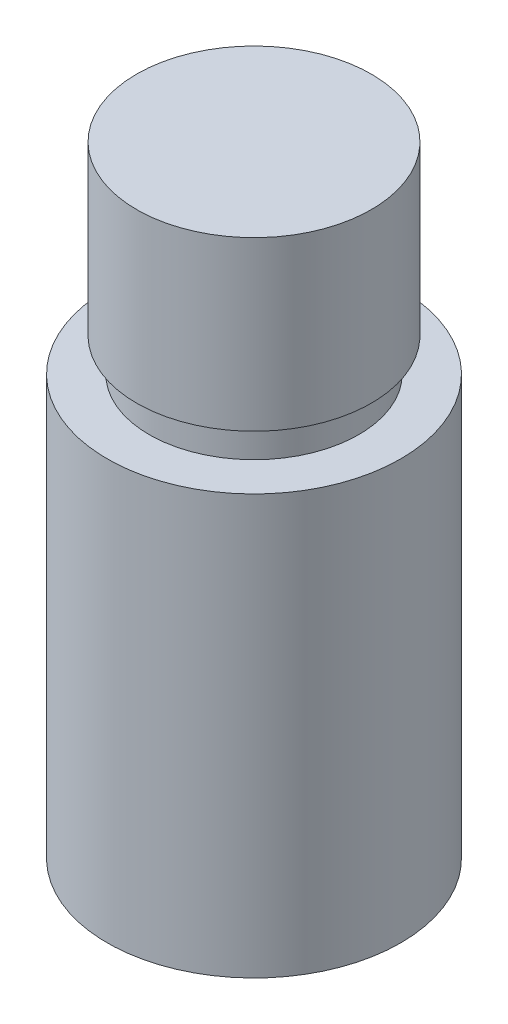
ISO-10303-21;
HEADER;
FILE_DESCRIPTION(('STEP AP214'),'2;1');
FILE_NAME('part.step','',(''),(''),'','','');
FILE_SCHEMA(('AUTOMOTIVE_DESIGN { 1 0 10303 214 1 1 1 1 }'));
ENDSEC;
DATA;
#1=APPLICATION_CONTEXT('core data for automotive mechanical design processes');
#2=APPLICATION_PROTOCOL_DEFINITION('international standard','automotive_design',2000,#1);
#3=PRODUCT_CONTEXT('',#1,'mechanical');
#4=PRODUCT('Part','Part','',(#3));
#5=PRODUCT_RELATED_PRODUCT_CATEGORY('part','',(#4));
#6=PRODUCT_DEFINITION_FORMATION('','',#4);
#7=PRODUCT_DEFINITION_CONTEXT('part definition',#1,'design');
#8=PRODUCT_DEFINITION('design','',#6,#7);
#9=PRODUCT_DEFINITION_SHAPE('','',#8);
#10=(LENGTH_UNIT() NAMED_UNIT(*) SI_UNIT(.MILLI.,.METRE.));
#11=(NAMED_UNIT(*) PLANE_ANGLE_UNIT() SI_UNIT($,.RADIAN.));
#12=(NAMED_UNIT(*) SI_UNIT($,.STERADIAN.) SOLID_ANGLE_UNIT());
#13=UNCERTAINTY_MEASURE_WITH_UNIT(LENGTH_MEASURE(1.E-05),#10,'distance_accuracy_value','');
#14=(GEOMETRIC_REPRESENTATION_CONTEXT(3) GLOBAL_UNCERTAINTY_ASSIGNED_CONTEXT((#13)) GLOBAL_UNIT_ASSIGNED_CONTEXT((#10,
#11,#12)) REPRESENTATION_CONTEXT('',''));
#15=CARTESIAN_POINT('',(0.,0.,0.));
#16=DIRECTION('',(0.,0.,1.));
#17=DIRECTION('',(1.,0.,0.));
#18=AXIS2_PLACEMENT_3D('',#15,#16,#17);
#19=CARTESIAN_POINT('',(0.,-50.,0.));
#20=DIRECTION('',(0.,-1.,0.));
#21=DIRECTION('',(1.,0.,0.));
#22=AXIS2_PLACEMENT_3D('',#19,#20,#21);
#23=PLANE('',#22);
#24=CARTESIAN_POINT('',(0.,-50.,0.));
#25=DIRECTION('',(0.,1.,0.));
#26=DIRECTION('',(-1.,0.,0.));
#27=AXIS2_PLACEMENT_3D('',#24,#25,#26);
#28=CIRCLE('',#27,35.);
#29=CARTESIAN_POINT('',(-35.,-50.,0.));
#30=VERTEX_POINT('',#29);
#31=EDGE_CURVE('E10',#30,#30,#28,.T.);
#32=ORIENTED_EDGE('',*,*,#31,.F.);
#33=EDGE_LOOP('',(#32));
#34=FACE_BOUND('',#33,.T.);
#35=ADVANCED_FACE('F29',(#34),#23,.T.);
#36=CARTESIAN_POINT('',(0.,98.,0.));
#37=DIRECTION('',(0.,1.,0.));
#38=DIRECTION('',(-1.,0.,0.));
#39=AXIS2_PLACEMENT_3D('',#36,#37,#38);
#40=CYLINDRICAL_SURFACE('',#39,35.);
#41=ORIENTED_EDGE('',*,*,#31,.T.);
#42=EDGE_LOOP('',(#41));
#43=FACE_BOUND('',#42,.T.);
#44=CARTESIAN_POINT('',(0.,50.,0.));
#45=DIRECTION('',(0.,1.,0.));
#46=DIRECTION('',(-1.,0.,0.));
#47=AXIS2_PLACEMENT_3D('',#44,#45,#46);
#48=CIRCLE('',#47,35.);
#49=CARTESIAN_POINT('',(-35.,50.,0.));
#50=VERTEX_POINT('',#49);
#51=EDGE_CURVE('E35',#50,#50,#48,.T.);
#52=ORIENTED_EDGE('',*,*,#51,.F.);
#53=EDGE_LOOP('',(#52));
#54=FACE_BOUND('',#53,.T.);
#55=ADVANCED_FACE('F71',(#43,#54),#40,.T.);
#56=CARTESIAN_POINT('',(-35.,50.,0.));
#57=DIRECTION('',(0.,1.,0.));
#58=DIRECTION('',(-1.,0.,0.));
#59=AXIS2_PLACEMENT_3D('',#56,#57,#58);
#60=PLANE('',#59);
#61=ORIENTED_EDGE('',*,*,#51,.T.);
#62=EDGE_LOOP('',(#61));
#63=FACE_BOUND('',#62,.T.);
#64=CARTESIAN_POINT('',(0.,50.,0.));
#65=DIRECTION('',(0.,1.,0.));
#66=DIRECTION('',(-1.,0.,0.));
#67=AXIS2_PLACEMENT_3D('',#64,#65,#66);
#68=CIRCLE('',#67,25.);
#69=CARTESIAN_POINT('',(-25.,50.,0.));
#70=VERTEX_POINT('',#69);
#71=EDGE_CURVE('E39',#70,#70,#68,.T.);
#72=ORIENTED_EDGE('',*,*,#71,.F.);
#73=EDGE_LOOP('',(#72));
#74=FACE_BOUND('',#73,.T.);
#75=ADVANCED_FACE('F76',(#63,#74),#60,.T.);
#76=CARTESIAN_POINT('',(0.,98.,0.));
#77=DIRECTION('',(0.,1.,0.));
#78=DIRECTION('',(-1.,0.,0.));
#79=AXIS2_PLACEMENT_3D('',#76,#77,#78);
#80=CYLINDRICAL_SURFACE('',#79,25.);
#81=ORIENTED_EDGE('',*,*,#71,.T.);
#82=EDGE_LOOP('',(#81));
#83=FACE_BOUND('',#82,.T.);
#84=CARTESIAN_POINT('',(0.,58.,0.));
#85=DIRECTION('',(0.,1.,0.));
#86=DIRECTION('',(-1.,0.,0.));
#87=AXIS2_PLACEMENT_3D('',#84,#85,#86);
#88=CIRCLE('',#87,25.);
#89=CARTESIAN_POINT('',(-25.,58.,0.));
#90=VERTEX_POINT('',#89);
#91=EDGE_CURVE('E43',#90,#90,#88,.T.);
#92=ORIENTED_EDGE('',*,*,#91,.F.);
#93=EDGE_LOOP('',(#92));
#94=FACE_BOUND('',#93,.T.);
#95=ADVANCED_FACE('F67',(#83,#94),#80,.T.);
#96=CARTESIAN_POINT('',(-25.,58.,0.));
#97=DIRECTION('',(0.,-1.,0.));
#98=DIRECTION('',(1.,0.,0.));
#99=AXIS2_PLACEMENT_3D('',#96,#97,#98);
#100=PLANE('',#99);
#101=ORIENTED_EDGE('',*,*,#91,.T.);
#102=EDGE_LOOP('',(#101));
#103=FACE_BOUND('',#102,.T.);
#104=CARTESIAN_POINT('',(0.,58.,0.));
#105=DIRECTION('',(0.,1.,0.));
#106=DIRECTION('',(-1.,0.,0.));
#107=AXIS2_PLACEMENT_3D('',#104,#105,#106);
#108=CIRCLE('',#107,28.);
#109=CARTESIAN_POINT('',(-28.,58.,0.));
#110=VERTEX_POINT('',#109);
#111=EDGE_CURVE('E48',#110,#110,#108,.T.);
#112=ORIENTED_EDGE('',*,*,#111,.F.);
#113=EDGE_LOOP('',(#112));
#114=FACE_BOUND('',#113,.T.);
#115=ADVANCED_FACE('F59',(#103,#114),#100,.T.);
#116=CARTESIAN_POINT('',(0.,98.,0.));
#117=DIRECTION('',(0.,1.,0.));
#118=DIRECTION('',(-1.,0.,0.));
#119=AXIS2_PLACEMENT_3D('',#116,#117,#118);
#120=CYLINDRICAL_SURFACE('',#119,28.);
#121=ORIENTED_EDGE('',*,*,#111,.T.);
#122=EDGE_LOOP('',(#121));
#123=FACE_BOUND('',#122,.T.);
#124=CARTESIAN_POINT('',(0.,98.,0.));
#125=DIRECTION('',(0.,1.,0.));
#126=DIRECTION('',(-1.,0.,0.));
#127=AXIS2_PLACEMENT_3D('',#124,#125,#126);
#128=CIRCLE('',#127,28.);
#129=CARTESIAN_POINT('',(-28.,98.,0.));
#130=VERTEX_POINT('',#129);
#131=EDGE_CURVE('E51',#130,#130,#128,.T.);
#132=ORIENTED_EDGE('',*,*,#131,.F.);
#133=EDGE_LOOP('',(#132));
#134=FACE_BOUND('',#133,.T.);
#135=ADVANCED_FACE('F57',(#123,#134),#120,.T.);
#136=CARTESIAN_POINT('',(-28.,98.,0.));
#137=DIRECTION('',(0.,1.,0.));
#138=DIRECTION('',(-1.,0.,0.));
#139=AXIS2_PLACEMENT_3D('',#136,#137,#138);
#140=PLANE('',#139);
#141=ORIENTED_EDGE('',*,*,#131,.T.);
#142=EDGE_LOOP('',(#141));
#143=FACE_BOUND('',#142,.T.);
#144=ADVANCED_FACE('F55',(#143),#140,.T.);
#145=CLOSED_SHELL('',(#35,#55,#75,#95,#115,#135,#144));
#146=MANIFOLD_SOLID_BREP('B2',#145);
#147=ADVANCED_BREP_SHAPE_REPRESENTATION('',(#18,#146),#14);
#148=SHAPE_DEFINITION_REPRESENTATION(#9,#147);
ENDSEC;
END-ISO-10303-21;
